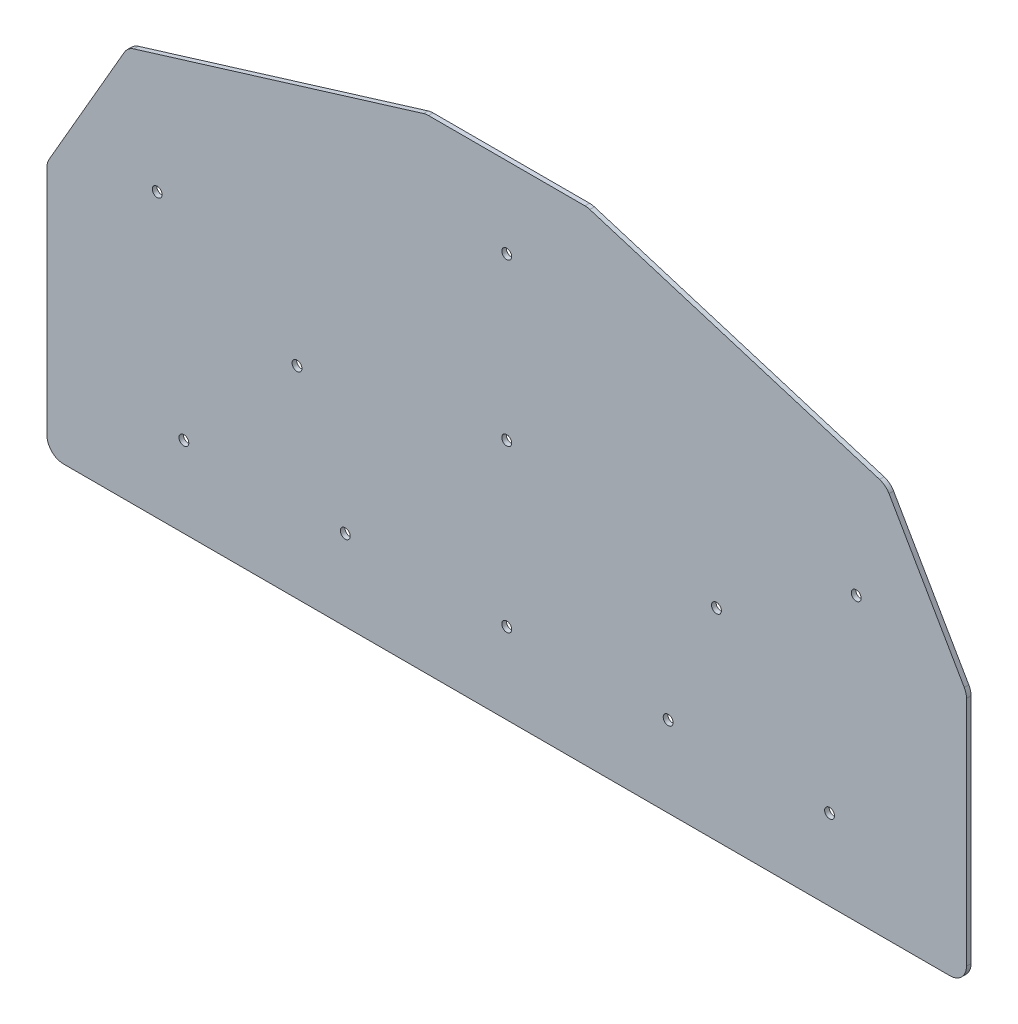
ISO-10303-21;
HEADER;
FILE_DESCRIPTION(('STEP AP214'),'2;1');
FILE_NAME('part.step','',(''),(''),'','','');
FILE_SCHEMA(('AUTOMOTIVE_DESIGN { 1 0 10303 214 1 1 1 1 }'));
ENDSEC;
DATA;
#1=APPLICATION_CONTEXT('core data for automotive mechanical design processes');
#2=APPLICATION_PROTOCOL_DEFINITION('international standard','automotive_design',2000,#1);
#3=PRODUCT_CONTEXT('',#1,'mechanical');
#4=PRODUCT('Part','Part','',(#3));
#5=PRODUCT_RELATED_PRODUCT_CATEGORY('part','',(#4));
#6=PRODUCT_DEFINITION_FORMATION('','',#4);
#7=PRODUCT_DEFINITION_CONTEXT('part definition',#1,'design');
#8=PRODUCT_DEFINITION('design','',#6,#7);
#9=PRODUCT_DEFINITION_SHAPE('','',#8);
#10=(LENGTH_UNIT() NAMED_UNIT(*) SI_UNIT(.MILLI.,.METRE.));
#11=(NAMED_UNIT(*) PLANE_ANGLE_UNIT() SI_UNIT($,.RADIAN.));
#12=(NAMED_UNIT(*) SI_UNIT($,.STERADIAN.) SOLID_ANGLE_UNIT());
#13=UNCERTAINTY_MEASURE_WITH_UNIT(LENGTH_MEASURE(1.E-05),#10,'distance_accuracy_value','');
#14=(GEOMETRIC_REPRESENTATION_CONTEXT(3) GLOBAL_UNCERTAINTY_ASSIGNED_CONTEXT((#13)) GLOBAL_UNIT_ASSIGNED_CONTEXT((#10,
#11,#12)) REPRESENTATION_CONTEXT('',''));
#15=CARTESIAN_POINT('',(0.,0.,0.));
#16=DIRECTION('',(0.,0.,1.));
#17=DIRECTION('',(1.,0.,0.));
#18=AXIS2_PLACEMENT_3D('',#15,#16,#17);
#19=CARTESIAN_POINT('',(153.7249135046,5.55625,1.524));
#20=DIRECTION('',(1.,0.,0.));
#21=DIRECTION('',(0.,0.,-1.));
#22=AXIS2_PLACEMENT_3D('',#19,#20,#21);
#23=PLANE('',#22);
#24=DIRECTION('',(0.,1.,0.));
#25=VECTOR('',#24,1.);
#26=CARTESIAN_POINT('',(153.7249135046,80.9625,1.524));
#27=LINE('',#26,#25);
#28=CARTESIAN_POINT('',(153.7249135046,5.5562499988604,1.524));
#29=VERTEX_POINT('',#28);
#30=CARTESIAN_POINT('',(153.7249135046,83.0893467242,1.524));
#31=VERTEX_POINT('',#30);
#32=EDGE_CURVE('E253',#29,#31,#27,.T.);
#33=ORIENTED_EDGE('',*,*,#32,.F.);
#34=DIRECTION('',(0.,0.,1.));
#35=VECTOR('',#34,1.);
#36=CARTESIAN_POINT('',(153.7249135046,5.55624999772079,0.762));
#37=LINE('',#36,#35);
#38=CARTESIAN_POINT('',(153.7249135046,5.5562499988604,0.));
#39=VERTEX_POINT('',#38);
#40=EDGE_CURVE('E152',#29,#39,#37,.F.);
#41=ORIENTED_EDGE('',*,*,#40,.T.);
#42=DIRECTION('',(0.,1.,0.));
#43=VECTOR('',#42,1.);
#44=CARTESIAN_POINT('',(153.7249135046,80.9625,0.));
#45=LINE('',#44,#43);
#46=CARTESIAN_POINT('',(153.7249135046,83.0893467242,0.));
#47=VERTEX_POINT('',#46);
#48=EDGE_CURVE('E289',#39,#47,#45,.T.);
#49=ORIENTED_EDGE('',*,*,#48,.T.);
#50=DIRECTION('',(0.,0.,-1.));
#51=VECTOR('',#50,1.);
#52=CARTESIAN_POINT('',(153.7249135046,83.0893467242,0.762));
#53=LINE('',#52,#51);
#54=EDGE_CURVE('E193',#47,#31,#53,.F.);
#55=ORIENTED_EDGE('',*,*,#54,.T.);
#56=EDGE_LOOP('',(#33,#41,#49,#55));
#57=FACE_BOUND('',#56,.T.);
#58=ADVANCED_FACE('F15',(#57),#23,.T.);
#59=CARTESIAN_POINT('',(148.1686635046,83.0893467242,0.));
#60=DIRECTION('',(0.,0.,1.));
#61=DIRECTION('',(1.,0.,0.));
#62=AXIS2_PLACEMENT_3D('',#59,#60,#61);
#63=CYLINDRICAL_SURFACE('',#62,5.55624999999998);
#64=ORIENTED_EDGE('',*,*,#54,.F.);
#65=CARTESIAN_POINT('',(148.1686635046,83.0893467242,0.));
#66=DIRECTION('',(0.,0.,1.));
#67=DIRECTION('',(1.,0.,0.));
#68=AXIS2_PLACEMENT_3D('',#65,#66,#67);
#69=CIRCLE('',#68,5.55624999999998);
#70=CARTESIAN_POINT('',(152.980517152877,85.8674717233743,0.));
#71=VERTEX_POINT('',#70);
#72=EDGE_CURVE('E286',#47,#71,#69,.T.);
#73=ORIENTED_EDGE('',*,*,#72,.T.);
#74=DIRECTION('',(0.,0.,1.));
#75=VECTOR('',#74,1.);
#76=CARTESIAN_POINT('',(152.9805171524,85.8674717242,0.762));
#77=LINE('',#76,#75);
#78=CARTESIAN_POINT('',(152.980517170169,85.8674717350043,1.524));
#79=VERTEX_POINT('',#78);
#80=EDGE_CURVE('E190',#71,#79,#77,.T.);
#81=ORIENTED_EDGE('',*,*,#80,.T.);
#82=CARTESIAN_POINT('',(148.1686635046,83.0893467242,1.524));
#83=DIRECTION('',(0.,0.,1.));
#84=DIRECTION('',(1.,0.,0.));
#85=AXIS2_PLACEMENT_3D('',#82,#83,#84);
#86=CIRCLE('',#85,5.55624999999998);
#87=EDGE_CURVE('E251',#31,#79,#86,.T.);
#88=ORIENTED_EDGE('',*,*,#87,.F.);
#89=EDGE_LOOP('',(#64,#73,#81,#88));
#90=FACE_BOUND('',#89,.T.);
#91=ADVANCED_FACE('F345',(#90),#63,.T.);
#92=CARTESIAN_POINT('',(127.8301796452,129.4291341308,0.));
#93=DIRECTION('',(-0.866025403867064,-0.499999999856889,0.));
#94=DIRECTION('',(0.499999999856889,-0.866025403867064,0.));
#95=AXIS2_PLACEMENT_3D('',#92,#93,#94);
#96=PLANE('',#95);
#97=ORIENTED_EDGE('',*,*,#80,.F.);
#98=DIRECTION('',(0.499999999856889,-0.866025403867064,0.));
#99=VECTOR('',#98,1.);
#100=CARTESIAN_POINT('',(127.8301796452,129.4291341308,0.));
#101=LINE('',#100,#99);
#102=CARTESIAN_POINT('',(127.830179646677,129.429134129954,0.));
#103=VERTEX_POINT('',#102);
#104=EDGE_CURVE('E284',#71,#103,#101,.F.);
#105=ORIENTED_EDGE('',*,*,#104,.T.);
#106=DIRECTION('',(0.,0.,-1.));
#107=VECTOR('',#106,1.);
#108=CARTESIAN_POINT('',(127.830179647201,129.429134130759,0.762));
#109=LINE('',#108,#107);
#110=CARTESIAN_POINT('',(127.83017965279,129.42913413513,1.524));
#111=VERTEX_POINT('',#110);
#112=EDGE_CURVE('E127',#103,#111,#109,.F.);
#113=ORIENTED_EDGE('',*,*,#112,.T.);
#114=DIRECTION('',(-0.500000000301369,0.866025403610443,0.));
#115=VECTOR('',#114,1.);
#116=CARTESIAN_POINT('',(152.980517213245,85.867471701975,1.524));
#117=LINE('',#116,#115);
#118=EDGE_CURVE('E249',#79,#111,#117,.T.);
#119=ORIENTED_EDGE('',*,*,#118,.F.);
#120=EDGE_LOOP('',(#97,#105,#113,#119));
#121=FACE_BOUND('',#120,.T.);
#122=ADVANCED_FACE('F348',(#121),#96,.F.);
#123=CARTESIAN_POINT('',(123.0183259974,126.6510091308,1.524));
#124=DIRECTION('',(0.,0.,-1.));
#125=DIRECTION('',(0.,1.,0.));
#126=AXIS2_PLACEMENT_3D('',#123,#124,#125);
#127=CYLINDRICAL_SURFACE('',#126,5.55625000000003);
#128=ORIENTED_EDGE('',*,*,#112,.F.);
#129=CARTESIAN_POINT('',(123.0183259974,126.6510091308,0.));
#130=DIRECTION('',(0.,0.,-1.));
#131=DIRECTION('',(0.,1.,0.));
#132=AXIS2_PLACEMENT_3D('',#129,#130,#131);
#133=CIRCLE('',#132,5.55625000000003);
#134=CARTESIAN_POINT('',(124.648003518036,131.962888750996,0.));
#135=VERTEX_POINT('',#134);
#136=EDGE_CURVE('E19',#103,#135,#133,.F.);
#137=ORIENTED_EDGE('',*,*,#136,.T.);
#138=DIRECTION('',(0.,0.,1.));
#139=VECTOR('',#138,1.);
#140=CARTESIAN_POINT('',(124.6480035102,131.9628887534,0.762));
#141=LINE('',#140,#139);
#142=CARTESIAN_POINT('',(124.648003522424,131.96288877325,1.524));
#143=VERTEX_POINT('',#142);
#144=EDGE_CURVE('E134',#135,#143,#141,.T.);
#145=ORIENTED_EDGE('',*,*,#144,.T.);
#146=CARTESIAN_POINT('',(123.0183259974,126.6510091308,1.524));
#147=DIRECTION('',(0.,0.,-1.));
#148=DIRECTION('',(0.,1.,0.));
#149=AXIS2_PLACEMENT_3D('',#146,#147,#148);
#150=CIRCLE('',#149,5.55625000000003);
#151=EDGE_CURVE('E247',#111,#143,#150,.F.);
#152=ORIENTED_EDGE('',*,*,#151,.F.);
#153=EDGE_LOOP('',(#128,#137,#145,#152));
#154=FACE_BOUND('',#153,.T.);
#155=ADVANCED_FACE('F151',(#154),#127,.T.);
#156=CARTESIAN_POINT('',(27.784017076,161.6806296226,0.));
#157=DIRECTION('',(-0.29330529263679,-0.956018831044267,0.));
#158=DIRECTION('',(0.956018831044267,-0.29330529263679,0.));
#159=AXIS2_PLACEMENT_3D('',#156,#157,#158);
#160=PLANE('',#159);
#161=ORIENTED_EDGE('',*,*,#144,.F.);
#162=DIRECTION('',(0.956018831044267,-0.29330529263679,0.));
#163=VECTOR('',#162,1.);
#164=CARTESIAN_POINT('',(27.784017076,161.6806296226,0.));
#165=LINE('',#164,#163);
#166=CARTESIAN_POINT('',(27.784017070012,161.680629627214,0.));
#167=VERTEX_POINT('',#166);
#168=EDGE_CURVE('E138',#135,#167,#165,.F.);
#169=ORIENTED_EDGE('',*,*,#168,.T.);
#170=DIRECTION('',(0.,0.,-1.));
#171=VECTOR('',#170,1.);
#172=CARTESIAN_POINT('',(27.7840170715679,161.680629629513,0.762));
#173=LINE('',#172,#171);
#174=CARTESIAN_POINT('',(27.7840170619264,161.68062960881,1.524));
#175=VERTEX_POINT('',#174);
#176=EDGE_CURVE('E140',#167,#175,#173,.F.);
#177=ORIENTED_EDGE('',*,*,#176,.T.);
#178=DIRECTION('',(-0.956018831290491,0.293305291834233,0.));
#179=VECTOR('',#178,1.);
#180=CARTESIAN_POINT('',(124.648003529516,131.962888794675,1.524));
#181=LINE('',#180,#179);
#182=EDGE_CURVE('E139',#143,#175,#181,.T.);
#183=ORIENTED_EDGE('',*,*,#182,.F.);
#184=EDGE_LOOP('',(#161,#169,#177,#183));
#185=FACE_BOUND('',#184,.T.);
#186=ADVANCED_FACE('F136',(#185),#160,.F.);
#187=CARTESIAN_POINT('',(26.1543395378,156.36875,1.524));
#188=DIRECTION('',(0.,0.,-1.));
#189=DIRECTION('',(0.,1.,0.));
#190=AXIS2_PLACEMENT_3D('',#187,#188,#189);
#191=CYLINDRICAL_SURFACE('',#190,5.55624999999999);
#192=ORIENTED_EDGE('',*,*,#176,.F.);
#193=CARTESIAN_POINT('',(26.1543395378,156.36875,0.));
#194=DIRECTION('',(0.,0.,-1.));
#195=DIRECTION('',(0.,1.,0.));
#196=AXIS2_PLACEMENT_3D('',#193,#194,#195);
#197=CIRCLE('',#196,5.55624999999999);
#198=CARTESIAN_POINT('',(26.1543395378,161.925,0.));
#199=VERTEX_POINT('',#198);
#200=EDGE_CURVE('E150',#167,#199,#197,.F.);
#201=ORIENTED_EDGE('',*,*,#200,.T.);
#202=DIRECTION('',(0.,0.,1.));
#203=VECTOR('',#202,1.);
#204=CARTESIAN_POINT('',(26.1543395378,161.925,0.762));
#205=LINE('',#204,#203);
#206=CARTESIAN_POINT('',(26.1543395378,161.925,1.524));
#207=VERTEX_POINT('',#206);
#208=EDGE_CURVE('E185',#199,#207,#205,.T.);
#209=ORIENTED_EDGE('',*,*,#208,.T.);
#210=CARTESIAN_POINT('',(26.1543395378,156.36875,1.524));
#211=DIRECTION('',(0.,0.,-1.));
#212=DIRECTION('',(0.,1.,0.));
#213=AXIS2_PLACEMENT_3D('',#210,#211,#212);
#214=CIRCLE('',#213,5.55624999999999);
#215=EDGE_CURVE('E244',#175,#207,#214,.F.);
#216=ORIENTED_EDGE('',*,*,#215,.F.);
#217=EDGE_LOOP('',(#192,#201,#209,#216));
#218=FACE_BOUND('',#217,.T.);
#219=ADVANCED_FACE('F371',(#218),#191,.T.);
#220=CARTESIAN_POINT('',(-26.1543395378,161.925,1.524));
#221=DIRECTION('',(0.,-1.,0.));
#222=DIRECTION('',(0.,0.,-1.));
#223=AXIS2_PLACEMENT_3D('',#220,#221,#222);
#224=PLANE('',#223);
#225=ORIENTED_EDGE('',*,*,#208,.F.);
#226=DIRECTION('',(-1.,0.,0.));
#227=VECTOR('',#226,1.);
#228=CARTESIAN_POINT('',(0.,161.925,0.));
#229=LINE('',#228,#227);
#230=CARTESIAN_POINT('',(-26.1543395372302,161.925,0.));
#231=VERTEX_POINT('',#230);
#232=EDGE_CURVE('E313',#199,#231,#229,.T.);
#233=ORIENTED_EDGE('',*,*,#232,.T.);
#234=DIRECTION('',(0.,0.,-1.));
#235=VECTOR('',#234,1.);
#236=CARTESIAN_POINT('',(-26.1543395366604,161.925,0.762));
#237=LINE('',#236,#235);
#238=CARTESIAN_POINT('',(-26.1543395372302,161.925,1.524));
#239=VERTEX_POINT('',#238);
#240=EDGE_CURVE('E182',#231,#239,#237,.F.);
#241=ORIENTED_EDGE('',*,*,#240,.T.);
#242=DIRECTION('',(-1.,0.,0.));
#243=VECTOR('',#242,1.);
#244=CARTESIAN_POINT('',(0.,161.925,1.524));
#245=LINE('',#244,#243);
#246=EDGE_CURVE('E243',#207,#239,#245,.T.);
#247=ORIENTED_EDGE('',*,*,#246,.F.);
#248=EDGE_LOOP('',(#225,#233,#241,#247));
#249=FACE_BOUND('',#248,.T.);
#250=ADVANCED_FACE('F369',(#249),#224,.F.);
#251=CARTESIAN_POINT('',(-26.1543395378,156.36875,1.524));
#252=DIRECTION('',(0.,0.,-1.));
#253=DIRECTION('',(0.,1.,0.));
#254=AXIS2_PLACEMENT_3D('',#251,#252,#253);
#255=CYLINDRICAL_SURFACE('',#254,5.55625000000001);
#256=ORIENTED_EDGE('',*,*,#240,.F.);
#257=CARTESIAN_POINT('',(-26.1543395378,156.36875,0.));
#258=DIRECTION('',(0.,0.,-1.));
#259=DIRECTION('',(0.,1.,0.));
#260=AXIS2_PLACEMENT_3D('',#257,#258,#259);
#261=CIRCLE('',#260,5.55625000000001);
#262=CARTESIAN_POINT('',(-27.784017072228,161.680629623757,0.));
#263=VERTEX_POINT('',#262);
#264=EDGE_CURVE('E310',#231,#263,#261,.F.);
#265=ORIENTED_EDGE('',*,*,#264,.T.);
#266=DIRECTION('',(0.,0.,1.));
#267=VECTOR('',#266,1.);
#268=CARTESIAN_POINT('',(-27.784017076,161.6806296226,0.762));
#269=LINE('',#268,#267);
#270=CARTESIAN_POINT('',(-27.7840170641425,161.680629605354,1.524));
#271=VERTEX_POINT('',#270);
#272=EDGE_CURVE('E179',#263,#271,#269,.T.);
#273=ORIENTED_EDGE('',*,*,#272,.T.);
#274=CARTESIAN_POINT('',(-26.1543395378,156.36875,1.524));
#275=DIRECTION('',(0.,0.,-1.));
#276=DIRECTION('',(0.,1.,0.));
#277=AXIS2_PLACEMENT_3D('',#274,#275,#276);
#278=CIRCLE('',#277,5.55625000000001);
#279=EDGE_CURVE('E241',#239,#271,#278,.F.);
#280=ORIENTED_EDGE('',*,*,#279,.F.);
#281=EDGE_LOOP('',(#256,#265,#273,#280));
#282=FACE_BOUND('',#281,.T.);
#283=ADVANCED_FACE('F366',(#282),#255,.T.);
#284=CARTESIAN_POINT('',(-124.6480035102,131.9628887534,0.));
#285=DIRECTION('',(0.29330529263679,-0.956018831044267,0.));
#286=DIRECTION('',(0.956018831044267,0.29330529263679,0.));
#287=AXIS2_PLACEMENT_3D('',#284,#285,#286);
#288=PLANE('',#287);
#289=ORIENTED_EDGE('',*,*,#272,.F.);
#290=DIRECTION('',(0.956018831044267,0.29330529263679,0.));
#291=VECTOR('',#290,1.);
#292=CARTESIAN_POINT('',(-124.6480035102,131.9628887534,0.));
#293=LINE('',#292,#291);
#294=CARTESIAN_POINT('',(-124.64800352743,131.962888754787,0.));
#295=VERTEX_POINT('',#294);
#296=EDGE_CURVE('E307',#263,#295,#293,.F.);
#297=ORIENTED_EDGE('',*,*,#296,.T.);
#298=DIRECTION('',(0.,0.,-1.));
#299=VECTOR('',#298,1.);
#300=CARTESIAN_POINT('',(-124.648003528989,131.962888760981,0.762));
#301=LINE('',#300,#299);
#302=CARTESIAN_POINT('',(-124.648003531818,131.962888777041,1.524));
#303=VERTEX_POINT('',#302);
#304=EDGE_CURVE('E176',#295,#303,#301,.F.);
#305=ORIENTED_EDGE('',*,*,#304,.T.);
#306=DIRECTION('',(-0.956018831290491,-0.293305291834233,0.));
#307=VECTOR('',#306,1.);
#308=CARTESIAN_POINT('',(-27.7840170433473,161.68062959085,1.524));
#309=LINE('',#308,#307);
#310=EDGE_CURVE('E239',#271,#303,#309,.T.);
#311=ORIENTED_EDGE('',*,*,#310,.F.);
#312=EDGE_LOOP('',(#289,#297,#305,#311));
#313=FACE_BOUND('',#312,.T.);
#314=ADVANCED_FACE('F363',(#313),#288,.F.);
#315=CARTESIAN_POINT('',(-123.0183259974,126.6510091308,1.524));
#316=DIRECTION('',(0.,0.,-1.));
#317=DIRECTION('',(0.,1.,0.));
#318=AXIS2_PLACEMENT_3D('',#315,#316,#317);
#319=CYLINDRICAL_SURFACE('',#318,5.55624999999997);
#320=ORIENTED_EDGE('',*,*,#304,.F.);
#321=CARTESIAN_POINT('',(-123.0183259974,126.6510091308,0.));
#322=DIRECTION('',(0.,0.,-1.));
#323=DIRECTION('',(0.,1.,0.));
#324=AXIS2_PLACEMENT_3D('',#321,#322,#323);
#325=CIRCLE('',#324,5.55624999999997);
#326=CARTESIAN_POINT('',(-127.830179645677,129.429134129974,0.));
#327=VERTEX_POINT('',#326);
#328=EDGE_CURVE('E304',#295,#327,#325,.F.);
#329=ORIENTED_EDGE('',*,*,#328,.T.);
#330=DIRECTION('',(0.,0.,1.));
#331=VECTOR('',#330,1.);
#332=CARTESIAN_POINT('',(-127.8301796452,129.4291341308,0.762));
#333=LINE('',#332,#331);
#334=CARTESIAN_POINT('',(-127.83017965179,129.42913413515,1.524));
#335=VERTEX_POINT('',#334);
#336=EDGE_CURVE('E173',#327,#335,#333,.T.);
#337=ORIENTED_EDGE('',*,*,#336,.T.);
#338=CARTESIAN_POINT('',(-123.0183259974,126.6510091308,1.524));
#339=DIRECTION('',(0.,0.,-1.));
#340=DIRECTION('',(0.,1.,0.));
#341=AXIS2_PLACEMENT_3D('',#338,#339,#340);
#342=CIRCLE('',#341,5.55624999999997);
#343=EDGE_CURVE('E237',#303,#335,#342,.F.);
#344=ORIENTED_EDGE('',*,*,#343,.F.);
#345=EDGE_LOOP('',(#320,#329,#337,#344));
#346=FACE_BOUND('',#345,.T.);
#347=ADVANCED_FACE('F359',(#346),#319,.T.);
#348=CARTESIAN_POINT('',(-152.9805171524,85.8674717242,0.));
#349=DIRECTION('',(0.866025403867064,-0.499999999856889,0.));
#350=DIRECTION('',(0.499999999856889,0.866025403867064,0.));
#351=AXIS2_PLACEMENT_3D('',#348,#349,#350);
#352=PLANE('',#351);
#353=DIRECTION('',(0.,0.,-1.));
#354=VECTOR('',#353,1.);
#355=CARTESIAN_POINT('',(-152.980517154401,85.8674717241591,0.762));
#356=LINE('',#355,#354);
#357=CARTESIAN_POINT('',(-152.980517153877,85.8674717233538,0.));
#358=VERTEX_POINT('',#357);
#359=CARTESIAN_POINT('',(-152.980517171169,85.8674717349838,1.524));
#360=VERTEX_POINT('',#359);
#361=EDGE_CURVE('E170',#358,#360,#356,.F.);
#362=ORIENTED_EDGE('',*,*,#361,.T.);
#363=DIRECTION('',(-0.500000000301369,-0.866025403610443,0.));
#364=VECTOR('',#363,1.);
#365=CARTESIAN_POINT('',(-127.830179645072,129.42913416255,1.524));
#366=LINE('',#365,#364);
#367=EDGE_CURVE('E235',#335,#360,#366,.T.);
#368=ORIENTED_EDGE('',*,*,#367,.F.);
#369=ORIENTED_EDGE('',*,*,#336,.F.);
#370=DIRECTION('',(0.499999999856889,0.866025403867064,0.));
#371=VECTOR('',#370,1.);
#372=CARTESIAN_POINT('',(-152.9805171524,85.8674717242,0.));
#373=LINE('',#372,#371);
#374=EDGE_CURVE('E301',#327,#358,#373,.F.);
#375=ORIENTED_EDGE('',*,*,#374,.T.);
#376=EDGE_LOOP('',(#362,#368,#369,#375));
#377=FACE_BOUND('',#376,.T.);
#378=ADVANCED_FACE('F355',(#377),#352,.F.);
#379=CARTESIAN_POINT('',(-148.1686635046,83.0893467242,0.));
#380=DIRECTION('',(0.,0.,1.));
#381=DIRECTION('',(1.,0.,0.));
#382=AXIS2_PLACEMENT_3D('',#379,#380,#381);
#383=CYLINDRICAL_SURFACE('',#382,5.55625000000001);
#384=ORIENTED_EDGE('',*,*,#361,.F.);
#385=CARTESIAN_POINT('',(-148.1686635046,83.0893467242,0.));
#386=DIRECTION('',(0.,0.,1.));
#387=DIRECTION('',(1.,0.,0.));
#388=AXIS2_PLACEMENT_3D('',#385,#386,#387);
#389=CIRCLE('',#388,5.55625000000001);
#390=CARTESIAN_POINT('',(-153.7249135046,83.0893467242,0.));
#391=VERTEX_POINT('',#390);
#392=EDGE_CURVE('E298',#358,#391,#389,.T.);
#393=ORIENTED_EDGE('',*,*,#392,.T.);
#394=DIRECTION('',(0.,0.,-1.));
#395=VECTOR('',#394,1.);
#396=CARTESIAN_POINT('',(-153.7249135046,83.0893467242,0.762));
#397=LINE('',#396,#395);
#398=CARTESIAN_POINT('',(-153.7249135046,83.0893467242,1.524));
#399=VERTEX_POINT('',#398);
#400=EDGE_CURVE('E168',#399,#391,#397,.T.);
#401=ORIENTED_EDGE('',*,*,#400,.F.);
#402=CARTESIAN_POINT('',(-148.1686635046,83.0893467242,1.524));
#403=DIRECTION('',(0.,0.,1.));
#404=DIRECTION('',(1.,0.,0.));
#405=AXIS2_PLACEMENT_3D('',#402,#403,#404);
#406=CIRCLE('',#405,5.55625000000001);
#407=EDGE_CURVE('E233',#360,#399,#406,.T.);
#408=ORIENTED_EDGE('',*,*,#407,.F.);
#409=EDGE_LOOP('',(#384,#393,#401,#408));
#410=FACE_BOUND('',#409,.T.);
#411=ADVANCED_FACE('F352',(#410),#383,.T.);
#412=CARTESIAN_POINT('',(-153.7249135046,5.55625,0.));
#413=DIRECTION('',(-1.,0.,0.));
#414=DIRECTION('',(0.,0.,1.));
#415=AXIS2_PLACEMENT_3D('',#412,#413,#414);
#416=PLANE('',#415);
#417=DIRECTION('',(0.,-1.,0.));
#418=VECTOR('',#417,1.);
#419=CARTESIAN_POINT('',(-153.7249135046,80.9625,0.));
#420=LINE('',#419,#418);
#421=CARTESIAN_POINT('',(-153.7249135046,5.55624999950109,0.));
#422=VERTEX_POINT('',#421);
#423=EDGE_CURVE('E297',#391,#422,#420,.T.);
#424=ORIENTED_EDGE('',*,*,#423,.T.);
#425=DIRECTION('',(0.,0.,-1.));
#426=VECTOR('',#425,1.);
#427=CARTESIAN_POINT('',(-153.7249135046,5.55624999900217,0.762));
#428=LINE('',#427,#426);
#429=CARTESIAN_POINT('',(-153.7249135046,5.55624999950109,1.524));
#430=VERTEX_POINT('',#429);
#431=EDGE_CURVE('E165',#422,#430,#428,.F.);
#432=ORIENTED_EDGE('',*,*,#431,.T.);
#433=DIRECTION('',(0.,-1.,0.));
#434=VECTOR('',#433,1.);
#435=CARTESIAN_POINT('',(-153.7249135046,80.9625,1.524));
#436=LINE('',#435,#434);
#437=EDGE_CURVE('E232',#399,#430,#436,.T.);
#438=ORIENTED_EDGE('',*,*,#437,.F.);
#439=ORIENTED_EDGE('',*,*,#400,.T.);
#440=EDGE_LOOP('',(#424,#432,#438,#439));
#441=FACE_BOUND('',#440,.T.);
#442=ADVANCED_FACE('F331',(#441),#416,.T.);
#443=CARTESIAN_POINT('',(-148.1686635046,5.55625,1.524));
#444=DIRECTION('',(0.,0.,-1.));
#445=DIRECTION('',(0.,1.,0.));
#446=AXIS2_PLACEMENT_3D('',#443,#444,#445);
#447=CYLINDRICAL_SURFACE('',#446,5.55624999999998);
#448=DIRECTION('',(0.,0.,1.));
#449=VECTOR('',#448,1.);
#450=CARTESIAN_POINT('',(-148.1686635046,0.,0.762));
#451=LINE('',#450,#449);
#452=CARTESIAN_POINT('',(-148.1686635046,0.,0.));
#453=VERTEX_POINT('',#452);
#454=CARTESIAN_POINT('',(-148.1686635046,0.,1.524));
#455=VERTEX_POINT('',#454);
#456=EDGE_CURVE('E159',#453,#455,#451,.T.);
#457=ORIENTED_EDGE('',*,*,#456,.T.);
#458=CARTESIAN_POINT('',(-148.1686635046,5.55625,1.524));
#459=DIRECTION('',(0.,0.,-1.));
#460=DIRECTION('',(0.,1.,0.));
#461=AXIS2_PLACEMENT_3D('',#458,#459,#460);
#462=CIRCLE('',#461,5.55624999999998);
#463=EDGE_CURVE('E230',#430,#455,#462,.F.);
#464=ORIENTED_EDGE('',*,*,#463,.F.);
#465=ORIENTED_EDGE('',*,*,#431,.F.);
#466=CARTESIAN_POINT('',(-148.1686635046,5.55625,0.));
#467=DIRECTION('',(0.,0.,-1.));
#468=DIRECTION('',(0.,1.,0.));
#469=AXIS2_PLACEMENT_3D('',#466,#467,#468);
#470=CIRCLE('',#469,5.55624999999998);
#471=EDGE_CURVE('E294',#422,#453,#470,.F.);
#472=ORIENTED_EDGE('',*,*,#471,.T.);
#473=EDGE_LOOP('',(#457,#464,#465,#472));
#474=FACE_BOUND('',#473,.T.);
#475=ADVANCED_FACE('F335',(#474),#447,.T.);
#476=CARTESIAN_POINT('',(148.1686635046,0.,0.));
#477=DIRECTION('',(0.,1.,0.));
#478=DIRECTION('',(-1.,0.,0.));
#479=AXIS2_PLACEMENT_3D('',#476,#477,#478);
#480=PLANE('',#479);
#481=DIRECTION('',(0.,0.,-1.));
#482=VECTOR('',#481,1.);
#483=CARTESIAN_POINT('',(148.168663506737,0.,0.762));
#484=LINE('',#483,#482);
#485=CARTESIAN_POINT('',(148.168663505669,0.,0.));
#486=VERTEX_POINT('',#485);
#487=CARTESIAN_POINT('',(148.168663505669,0.,1.524));
#488=VERTEX_POINT('',#487);
#489=EDGE_CURVE('E153',#486,#488,#484,.F.);
#490=ORIENTED_EDGE('',*,*,#489,.T.);
#491=DIRECTION('',(1.,0.,0.));
#492=VECTOR('',#491,1.);
#493=CARTESIAN_POINT('',(0.,0.,1.524));
#494=LINE('',#493,#492);
#495=EDGE_CURVE('E34',#455,#488,#494,.T.);
#496=ORIENTED_EDGE('',*,*,#495,.F.);
#497=ORIENTED_EDGE('',*,*,#456,.F.);
#498=DIRECTION('',(1.,0.,0.));
#499=VECTOR('',#498,1.);
#500=CARTESIAN_POINT('',(0.,0.,0.));
#501=LINE('',#500,#499);
#502=EDGE_CURVE('E293',#453,#486,#501,.T.);
#503=ORIENTED_EDGE('',*,*,#502,.T.);
#504=EDGE_LOOP('',(#490,#496,#497,#503));
#505=FACE_BOUND('',#504,.T.);
#506=ADVANCED_FACE('F338',(#505),#480,.F.);
#507=CARTESIAN_POINT('',(148.1686635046,5.55625,1.524));
#508=DIRECTION('',(0.,0.,-1.));
#509=DIRECTION('',(0.,1.,0.));
#510=AXIS2_PLACEMENT_3D('',#507,#508,#509);
#511=CYLINDRICAL_SURFACE('',#510,5.55625000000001);
#512=ORIENTED_EDGE('',*,*,#40,.F.);
#513=CARTESIAN_POINT('',(148.1686635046,5.55625,1.524));
#514=DIRECTION('',(0.,0.,-1.));
#515=DIRECTION('',(0.,1.,0.));
#516=AXIS2_PLACEMENT_3D('',#513,#514,#515);
#517=CIRCLE('',#516,5.55625000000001);
#518=EDGE_CURVE('E228',#488,#29,#517,.F.);
#519=ORIENTED_EDGE('',*,*,#518,.F.);
#520=ORIENTED_EDGE('',*,*,#489,.F.);
#521=CARTESIAN_POINT('',(148.1686635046,5.55625,0.));
#522=DIRECTION('',(0.,0.,-1.));
#523=DIRECTION('',(0.,1.,0.));
#524=AXIS2_PLACEMENT_3D('',#521,#522,#523);
#525=CIRCLE('',#524,5.55625000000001);
#526=EDGE_CURVE('E290',#486,#39,#525,.F.);
#527=ORIENTED_EDGE('',*,*,#526,.T.);
#528=EDGE_LOOP('',(#512,#519,#520,#527));
#529=FACE_BOUND('',#528,.T.);
#530=ADVANCED_FACE('F342',(#529),#511,.T.);
#531=CARTESIAN_POINT('',(0.,134.9375,0.));
#532=DIRECTION('',(0.,0.,1.));
#533=DIRECTION('',(1.,0.,0.));
#534=AXIS2_PLACEMENT_3D('',#531,#532,#533);
#535=CYLINDRICAL_SURFACE('',#534,1.651);
#536=CARTESIAN_POINT('',(0.,134.9375,1.524));
#537=DIRECTION('',(0.,0.,1.));
#538=DIRECTION('',(1.,0.,0.));
#539=AXIS2_PLACEMENT_3D('',#536,#537,#538);
#540=CIRCLE('',#539,1.651);
#541=CARTESIAN_POINT('',(1.651,134.9375,1.524));
#542=VERTEX_POINT('',#541);
#543=EDGE_CURVE('E225',#542,#542,#540,.F.);
#544=ORIENTED_EDGE('',*,*,#543,.F.);
#545=EDGE_LOOP('',(#544));
#546=FACE_BOUND('',#545,.T.);
#547=CARTESIAN_POINT('',(0.,134.9375,0.));
#548=DIRECTION('',(0.,0.,1.));
#549=DIRECTION('',(1.,0.,0.));
#550=AXIS2_PLACEMENT_3D('',#547,#548,#549);
#551=CIRCLE('',#550,1.651);
#552=CARTESIAN_POINT('',(1.651,134.9375,0.));
#553=VERTEX_POINT('',#552);
#554=EDGE_CURVE('E281',#553,#553,#551,.F.);
#555=ORIENTED_EDGE('',*,*,#554,.T.);
#556=EDGE_LOOP('',(#555));
#557=FACE_BOUND('',#556,.T.);
#558=ADVANCED_FACE('F428',(#546,#557),#535,.F.);
#559=CARTESIAN_POINT('',(0.,80.9625,0.));
#560=DIRECTION('',(0.,0.,1.));
#561=DIRECTION('',(1.,0.,0.));
#562=AXIS2_PLACEMENT_3D('',#559,#560,#561);
#563=CYLINDRICAL_SURFACE('',#562,1.651);
#564=CARTESIAN_POINT('',(0.,80.9625,1.524));
#565=DIRECTION('',(0.,0.,1.));
#566=DIRECTION('',(1.,0.,0.));
#567=AXIS2_PLACEMENT_3D('',#564,#565,#566);
#568=CIRCLE('',#567,1.651);
#569=CARTESIAN_POINT('',(1.651,80.9625,1.524));
#570=VERTEX_POINT('',#569);
#571=EDGE_CURVE('E222',#570,#570,#568,.F.);
#572=ORIENTED_EDGE('',*,*,#571,.F.);
#573=EDGE_LOOP('',(#572));
#574=FACE_BOUND('',#573,.T.);
#575=CARTESIAN_POINT('',(0.,80.9625,0.));
#576=DIRECTION('',(0.,0.,1.));
#577=DIRECTION('',(1.,0.,0.));
#578=AXIS2_PLACEMENT_3D('',#575,#576,#577);
#579=CIRCLE('',#578,1.651);
#580=CARTESIAN_POINT('',(1.651,80.9625,0.));
#581=VERTEX_POINT('',#580);
#582=EDGE_CURVE('E278',#581,#581,#579,.F.);
#583=ORIENTED_EDGE('',*,*,#582,.T.);
#584=EDGE_LOOP('',(#583));
#585=FACE_BOUND('',#584,.T.);
#586=ADVANCED_FACE('F424',(#574,#585),#563,.F.);
#587=CARTESIAN_POINT('',(-107.95,26.9875,0.));
#588=DIRECTION('',(0.,0.,1.));
#589=DIRECTION('',(1.,0.,0.));
#590=AXIS2_PLACEMENT_3D('',#587,#588,#589);
#591=CYLINDRICAL_SURFACE('',#590,1.651);
#592=CARTESIAN_POINT('',(-107.95,26.9875,1.524));
#593=DIRECTION('',(0.,0.,1.));
#594=DIRECTION('',(1.,0.,0.));
#595=AXIS2_PLACEMENT_3D('',#592,#593,#594);
#596=CIRCLE('',#595,1.651);
#597=CARTESIAN_POINT('',(-106.299,26.9875,1.524));
#598=VERTEX_POINT('',#597);
#599=EDGE_CURVE('E219',#598,#598,#596,.F.);
#600=ORIENTED_EDGE('',*,*,#599,.F.);
#601=EDGE_LOOP('',(#600));
#602=FACE_BOUND('',#601,.T.);
#603=CARTESIAN_POINT('',(-107.95,26.9875,0.));
#604=DIRECTION('',(0.,0.,1.));
#605=DIRECTION('',(1.,0.,0.));
#606=AXIS2_PLACEMENT_3D('',#603,#604,#605);
#607=CIRCLE('',#606,1.651);
#608=CARTESIAN_POINT('',(-106.299,26.9875,0.));
#609=VERTEX_POINT('',#608);
#610=EDGE_CURVE('E275',#609,#609,#607,.F.);
#611=ORIENTED_EDGE('',*,*,#610,.T.);
#612=EDGE_LOOP('',(#611));
#613=FACE_BOUND('',#612,.T.);
#614=ADVANCED_FACE('F420',(#602,#613),#591,.F.);
#615=CARTESIAN_POINT('',(107.95,26.9875,0.));
#616=DIRECTION('',(0.,0.,1.));
#617=DIRECTION('',(1.,0.,0.));
#618=AXIS2_PLACEMENT_3D('',#615,#616,#617);
#619=CYLINDRICAL_SURFACE('',#618,1.651);
#620=CARTESIAN_POINT('',(107.95,26.9875,1.524));
#621=DIRECTION('',(0.,0.,1.));
#622=DIRECTION('',(1.,0.,0.));
#623=AXIS2_PLACEMENT_3D('',#620,#621,#622);
#624=CIRCLE('',#623,1.651);
#625=CARTESIAN_POINT('',(109.601,26.9875,1.524));
#626=VERTEX_POINT('',#625);
#627=EDGE_CURVE('E216',#626,#626,#624,.F.);
#628=ORIENTED_EDGE('',*,*,#627,.F.);
#629=EDGE_LOOP('',(#628));
#630=FACE_BOUND('',#629,.T.);
#631=CARTESIAN_POINT('',(107.95,26.9875,0.));
#632=DIRECTION('',(0.,0.,1.));
#633=DIRECTION('',(1.,0.,0.));
#634=AXIS2_PLACEMENT_3D('',#631,#632,#633);
#635=CIRCLE('',#634,1.651);
#636=CARTESIAN_POINT('',(109.601,26.9875,0.));
#637=VERTEX_POINT('',#636);
#638=EDGE_CURVE('E272',#637,#637,#635,.F.);
#639=ORIENTED_EDGE('',*,*,#638,.T.);
#640=EDGE_LOOP('',(#639));
#641=FACE_BOUND('',#640,.T.);
#642=ADVANCED_FACE('F416',(#630,#641),#619,.F.);
#643=CARTESIAN_POINT('',(116.8593029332,94.45625,0.));
#644=DIRECTION('',(0.,0.,1.));
#645=DIRECTION('',(1.,0.,0.));
#646=AXIS2_PLACEMENT_3D('',#643,#644,#645);
#647=CYLINDRICAL_SURFACE('',#646,1.65099999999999);
#648=CARTESIAN_POINT('',(116.8593029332,94.45625,1.524));
#649=DIRECTION('',(0.,0.,1.));
#650=DIRECTION('',(1.,0.,0.));
#651=AXIS2_PLACEMENT_3D('',#648,#649,#650);
#652=CIRCLE('',#651,1.65099999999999);
#653=CARTESIAN_POINT('',(118.5103029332,94.45625,1.524));
#654=VERTEX_POINT('',#653);
#655=EDGE_CURVE('E213',#654,#654,#652,.F.);
#656=ORIENTED_EDGE('',*,*,#655,.F.);
#657=EDGE_LOOP('',(#656));
#658=FACE_BOUND('',#657,.T.);
#659=CARTESIAN_POINT('',(116.8593029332,94.45625,0.));
#660=DIRECTION('',(0.,0.,1.));
#661=DIRECTION('',(1.,0.,0.));
#662=AXIS2_PLACEMENT_3D('',#659,#660,#661);
#663=CIRCLE('',#662,1.65099999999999);
#664=CARTESIAN_POINT('',(118.5103029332,94.45625,0.));
#665=VERTEX_POINT('',#664);
#666=EDGE_CURVE('E269',#665,#665,#663,.F.);
#667=ORIENTED_EDGE('',*,*,#666,.T.);
#668=EDGE_LOOP('',(#667));
#669=FACE_BOUND('',#668,.T.);
#670=ADVANCED_FACE('F412',(#658,#669),#647,.F.);
#671=CARTESIAN_POINT('',(70.115581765,67.46875,0.));
#672=DIRECTION('',(0.,0.,1.));
#673=DIRECTION('',(1.,0.,0.));
#674=AXIS2_PLACEMENT_3D('',#671,#672,#673);
#675=CYLINDRICAL_SURFACE('',#674,1.65099999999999);
#676=CARTESIAN_POINT('',(70.115581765,67.46875,1.524));
#677=DIRECTION('',(0.,0.,1.));
#678=DIRECTION('',(1.,0.,0.));
#679=AXIS2_PLACEMENT_3D('',#676,#677,#678);
#680=CIRCLE('',#679,1.65099999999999);
#681=CARTESIAN_POINT('',(71.766581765,67.46875,1.524));
#682=VERTEX_POINT('',#681);
#683=EDGE_CURVE('E210',#682,#682,#680,.F.);
#684=ORIENTED_EDGE('',*,*,#683,.F.);
#685=EDGE_LOOP('',(#684));
#686=FACE_BOUND('',#685,.T.);
#687=CARTESIAN_POINT('',(70.115581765,67.46875,0.));
#688=DIRECTION('',(0.,0.,1.));
#689=DIRECTION('',(1.,0.,0.));
#690=AXIS2_PLACEMENT_3D('',#687,#688,#689);
#691=CIRCLE('',#690,1.65099999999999);
#692=CARTESIAN_POINT('',(71.766581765,67.46875,0.));
#693=VERTEX_POINT('',#692);
#694=EDGE_CURVE('E266',#693,#693,#691,.F.);
#695=ORIENTED_EDGE('',*,*,#694,.T.);
#696=EDGE_LOOP('',(#695));
#697=FACE_BOUND('',#696,.T.);
#698=ADVANCED_FACE('F408',(#686,#697),#675,.F.);
#699=CARTESIAN_POINT('',(-116.8593029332,94.45625,0.));
#700=DIRECTION('',(0.,0.,1.));
#701=DIRECTION('',(1.,0.,0.));
#702=AXIS2_PLACEMENT_3D('',#699,#700,#701);
#703=CYLINDRICAL_SURFACE('',#702,1.651);
#704=CARTESIAN_POINT('',(-116.8593029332,94.45625,1.524));
#705=DIRECTION('',(0.,0.,1.));
#706=DIRECTION('',(1.,0.,0.));
#707=AXIS2_PLACEMENT_3D('',#704,#705,#706);
#708=CIRCLE('',#707,1.651);
#709=CARTESIAN_POINT('',(-115.2083029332,94.45625,1.524));
#710=VERTEX_POINT('',#709);
#711=EDGE_CURVE('E207',#710,#710,#708,.F.);
#712=ORIENTED_EDGE('',*,*,#711,.F.);
#713=EDGE_LOOP('',(#712));
#714=FACE_BOUND('',#713,.T.);
#715=CARTESIAN_POINT('',(-116.8593029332,94.45625,0.));
#716=DIRECTION('',(0.,0.,1.));
#717=DIRECTION('',(1.,0.,0.));
#718=AXIS2_PLACEMENT_3D('',#715,#716,#717);
#719=CIRCLE('',#718,1.651);
#720=CARTESIAN_POINT('',(-115.2083029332,94.45625,0.));
#721=VERTEX_POINT('',#720);
#722=EDGE_CURVE('E263',#721,#721,#719,.F.);
#723=ORIENTED_EDGE('',*,*,#722,.T.);
#724=EDGE_LOOP('',(#723));
#725=FACE_BOUND('',#724,.T.);
#726=ADVANCED_FACE('F404',(#714,#725),#703,.F.);
#727=CARTESIAN_POINT('',(-70.115581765,67.46875,0.));
#728=DIRECTION('',(0.,0.,1.));
#729=DIRECTION('',(1.,0.,0.));
#730=AXIS2_PLACEMENT_3D('',#727,#728,#729);
#731=CYLINDRICAL_SURFACE('',#730,1.65100000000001);
#732=CARTESIAN_POINT('',(-70.115581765,67.46875,1.524));
#733=DIRECTION('',(0.,0.,1.));
#734=DIRECTION('',(1.,0.,0.));
#735=AXIS2_PLACEMENT_3D('',#732,#733,#734);
#736=CIRCLE('',#735,1.65100000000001);
#737=CARTESIAN_POINT('',(-68.464581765,67.46875,1.524));
#738=VERTEX_POINT('',#737);
#739=EDGE_CURVE('E204',#738,#738,#736,.F.);
#740=ORIENTED_EDGE('',*,*,#739,.F.);
#741=EDGE_LOOP('',(#740));
#742=FACE_BOUND('',#741,.T.);
#743=CARTESIAN_POINT('',(-70.115581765,67.46875,0.));
#744=DIRECTION('',(0.,0.,1.));
#745=DIRECTION('',(1.,0.,0.));
#746=AXIS2_PLACEMENT_3D('',#743,#744,#745);
#747=CIRCLE('',#746,1.65100000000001);
#748=CARTESIAN_POINT('',(-68.464581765,67.46875,0.));
#749=VERTEX_POINT('',#748);
#750=EDGE_CURVE('E260',#749,#749,#747,.F.);
#751=ORIENTED_EDGE('',*,*,#750,.T.);
#752=EDGE_LOOP('',(#751));
#753=FACE_BOUND('',#752,.T.);
#754=ADVANCED_FACE('F400',(#742,#753),#731,.F.);
#755=CARTESIAN_POINT('',(-53.975,26.9875,0.));
#756=DIRECTION('',(0.,0.,1.));
#757=DIRECTION('',(1.,0.,0.));
#758=AXIS2_PLACEMENT_3D('',#755,#756,#757);
#759=CYLINDRICAL_SURFACE('',#758,1.65099999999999);
#760=CARTESIAN_POINT('',(-53.975,26.9875,1.524));
#761=DIRECTION('',(0.,0.,1.));
#762=DIRECTION('',(1.,0.,0.));
#763=AXIS2_PLACEMENT_3D('',#760,#761,#762);
#764=CIRCLE('',#763,1.65099999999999);
#765=CARTESIAN_POINT('',(-52.324,26.9875,1.524));
#766=VERTEX_POINT('',#765);
#767=EDGE_CURVE('E201',#766,#766,#764,.F.);
#768=ORIENTED_EDGE('',*,*,#767,.F.);
#769=EDGE_LOOP('',(#768));
#770=FACE_BOUND('',#769,.T.);
#771=CARTESIAN_POINT('',(-53.975,26.9875,0.));
#772=DIRECTION('',(0.,0.,1.));
#773=DIRECTION('',(1.,0.,0.));
#774=AXIS2_PLACEMENT_3D('',#771,#772,#773);
#775=CIRCLE('',#774,1.65099999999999);
#776=CARTESIAN_POINT('',(-52.324,26.9875,0.));
#777=VERTEX_POINT('',#776);
#778=EDGE_CURVE('E257',#777,#777,#775,.F.);
#779=ORIENTED_EDGE('',*,*,#778,.T.);
#780=EDGE_LOOP('',(#779));
#781=FACE_BOUND('',#780,.T.);
#782=ADVANCED_FACE('F396',(#770,#781),#759,.F.);
#783=CARTESIAN_POINT('',(53.975,26.9875,0.));
#784=DIRECTION('',(0.,0.,1.));
#785=DIRECTION('',(1.,0.,0.));
#786=AXIS2_PLACEMENT_3D('',#783,#784,#785);
#787=CYLINDRICAL_SURFACE('',#786,1.651);
#788=CARTESIAN_POINT('',(53.975,26.9875,1.524));
#789=DIRECTION('',(0.,0.,1.));
#790=DIRECTION('',(1.,0.,0.));
#791=AXIS2_PLACEMENT_3D('',#788,#789,#790);
#792=CIRCLE('',#791,1.651);
#793=CARTESIAN_POINT('',(55.626,26.9875,1.524));
#794=VERTEX_POINT('',#793);
#795=EDGE_CURVE('E198',#794,#794,#792,.F.);
#796=ORIENTED_EDGE('',*,*,#795,.F.);
#797=EDGE_LOOP('',(#796));
#798=FACE_BOUND('',#797,.T.);
#799=CARTESIAN_POINT('',(53.975,26.9875,0.));
#800=DIRECTION('',(0.,0.,1.));
#801=DIRECTION('',(1.,0.,0.));
#802=AXIS2_PLACEMENT_3D('',#799,#800,#801);
#803=CIRCLE('',#802,1.651);
#804=CARTESIAN_POINT('',(55.626,26.9875,0.));
#805=VERTEX_POINT('',#804);
#806=EDGE_CURVE('E254',#805,#805,#803,.F.);
#807=ORIENTED_EDGE('',*,*,#806,.T.);
#808=EDGE_LOOP('',(#807));
#809=FACE_BOUND('',#808,.T.);
#810=ADVANCED_FACE('F393',(#798,#809),#787,.F.);
#811=CARTESIAN_POINT('',(-153.7249135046,0.,0.));
#812=DIRECTION('',(0.,0.,1.));
#813=DIRECTION('',(1.,0.,0.));
#814=AXIS2_PLACEMENT_3D('',#811,#812,#813);
#815=PLANE('',#814);
#816=ORIENTED_EDGE('',*,*,#806,.F.);
#817=EDGE_LOOP('',(#816));
#818=FACE_BOUND('',#817,.T.);
#819=ORIENTED_EDGE('',*,*,#778,.F.);
#820=EDGE_LOOP('',(#819));
#821=FACE_BOUND('',#820,.T.);
#822=ORIENTED_EDGE('',*,*,#750,.F.);
#823=EDGE_LOOP('',(#822));
#824=FACE_BOUND('',#823,.T.);
#825=ORIENTED_EDGE('',*,*,#722,.F.);
#826=EDGE_LOOP('',(#825));
#827=FACE_BOUND('',#826,.T.);
#828=ORIENTED_EDGE('',*,*,#694,.F.);
#829=EDGE_LOOP('',(#828));
#830=FACE_BOUND('',#829,.T.);
#831=ORIENTED_EDGE('',*,*,#666,.F.);
#832=EDGE_LOOP('',(#831));
#833=FACE_BOUND('',#832,.T.);
#834=ORIENTED_EDGE('',*,*,#638,.F.);
#835=EDGE_LOOP('',(#834));
#836=FACE_BOUND('',#835,.T.);
#837=ORIENTED_EDGE('',*,*,#610,.F.);
#838=EDGE_LOOP('',(#837));
#839=FACE_BOUND('',#838,.T.);
#840=ORIENTED_EDGE('',*,*,#582,.F.);
#841=EDGE_LOOP('',(#840));
#842=FACE_BOUND('',#841,.T.);
#843=ORIENTED_EDGE('',*,*,#554,.F.);
#844=EDGE_LOOP('',(#843));
#845=FACE_BOUND('',#844,.T.);
#846=CARTESIAN_POINT('',(0.,26.9875,0.));
#847=DIRECTION('',(0.,0.,1.));
#848=DIRECTION('',(1.,0.,0.));
#849=AXIS2_PLACEMENT_3D('',#846,#847,#848);
#850=CIRCLE('',#849,1.651);
#851=CARTESIAN_POINT('',(1.651,26.9875,0.));
#852=VERTEX_POINT('',#851);
#853=EDGE_CURVE('E25',#852,#852,#850,.F.);
#854=ORIENTED_EDGE('',*,*,#853,.F.);
#855=EDGE_LOOP('',(#854));
#856=FACE_BOUND('',#855,.T.);
#857=ORIENTED_EDGE('',*,*,#72,.F.);
#858=ORIENTED_EDGE('',*,*,#48,.F.);
#859=ORIENTED_EDGE('',*,*,#526,.F.);
#860=ORIENTED_EDGE('',*,*,#502,.F.);
#861=ORIENTED_EDGE('',*,*,#471,.F.);
#862=ORIENTED_EDGE('',*,*,#423,.F.);
#863=ORIENTED_EDGE('',*,*,#392,.F.);
#864=ORIENTED_EDGE('',*,*,#374,.F.);
#865=ORIENTED_EDGE('',*,*,#328,.F.);
#866=ORIENTED_EDGE('',*,*,#296,.F.);
#867=ORIENTED_EDGE('',*,*,#264,.F.);
#868=ORIENTED_EDGE('',*,*,#232,.F.);
#869=ORIENTED_EDGE('',*,*,#200,.F.);
#870=ORIENTED_EDGE('',*,*,#168,.F.);
#871=ORIENTED_EDGE('',*,*,#136,.F.);
#872=ORIENTED_EDGE('',*,*,#104,.F.);
#873=EDGE_LOOP('',(#857,#858,#859,#860,#861,#862,#863,#864,#865,#866,#867,#868,#869,#870,#871,#872));
#874=FACE_BOUND('',#873,.T.);
#875=ADVANCED_FACE('F145',(#818,#821,#824,#827,#830,#833,#836,#839,#842,#845,#856,#874),#815,.F.);
#876=CARTESIAN_POINT('',(-153.7249135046,0.,1.524));
#877=DIRECTION('',(0.,0.,1.));
#878=DIRECTION('',(1.,0.,0.));
#879=AXIS2_PLACEMENT_3D('',#876,#877,#878);
#880=PLANE('',#879);
#881=ORIENTED_EDGE('',*,*,#795,.T.);
#882=EDGE_LOOP('',(#881));
#883=FACE_BOUND('',#882,.T.);
#884=ORIENTED_EDGE('',*,*,#767,.T.);
#885=EDGE_LOOP('',(#884));
#886=FACE_BOUND('',#885,.T.);
#887=ORIENTED_EDGE('',*,*,#739,.T.);
#888=EDGE_LOOP('',(#887));
#889=FACE_BOUND('',#888,.T.);
#890=ORIENTED_EDGE('',*,*,#711,.T.);
#891=EDGE_LOOP('',(#890));
#892=FACE_BOUND('',#891,.T.);
#893=ORIENTED_EDGE('',*,*,#683,.T.);
#894=EDGE_LOOP('',(#893));
#895=FACE_BOUND('',#894,.T.);
#896=ORIENTED_EDGE('',*,*,#655,.T.);
#897=EDGE_LOOP('',(#896));
#898=FACE_BOUND('',#897,.T.);
#899=ORIENTED_EDGE('',*,*,#627,.T.);
#900=EDGE_LOOP('',(#899));
#901=FACE_BOUND('',#900,.T.);
#902=ORIENTED_EDGE('',*,*,#599,.T.);
#903=EDGE_LOOP('',(#902));
#904=FACE_BOUND('',#903,.T.);
#905=ORIENTED_EDGE('',*,*,#571,.T.);
#906=EDGE_LOOP('',(#905));
#907=FACE_BOUND('',#906,.T.);
#908=ORIENTED_EDGE('',*,*,#543,.T.);
#909=EDGE_LOOP('',(#908));
#910=FACE_BOUND('',#909,.T.);
#911=CARTESIAN_POINT('',(0.,26.9875,1.524));
#912=DIRECTION('',(0.,0.,1.));
#913=DIRECTION('',(1.,0.,0.));
#914=AXIS2_PLACEMENT_3D('',#911,#912,#913);
#915=CIRCLE('',#914,1.651);
#916=CARTESIAN_POINT('',(1.651,26.9875,1.524));
#917=VERTEX_POINT('',#916);
#918=EDGE_CURVE('E9',#917,#917,#915,.T.);
#919=ORIENTED_EDGE('',*,*,#918,.F.);
#920=EDGE_LOOP('',(#919));
#921=FACE_BOUND('',#920,.T.);
#922=ORIENTED_EDGE('',*,*,#495,.T.);
#923=ORIENTED_EDGE('',*,*,#518,.T.);
#924=ORIENTED_EDGE('',*,*,#32,.T.);
#925=ORIENTED_EDGE('',*,*,#87,.T.);
#926=ORIENTED_EDGE('',*,*,#118,.T.);
#927=ORIENTED_EDGE('',*,*,#151,.T.);
#928=ORIENTED_EDGE('',*,*,#182,.T.);
#929=ORIENTED_EDGE('',*,*,#215,.T.);
#930=ORIENTED_EDGE('',*,*,#246,.T.);
#931=ORIENTED_EDGE('',*,*,#279,.T.);
#932=ORIENTED_EDGE('',*,*,#310,.T.);
#933=ORIENTED_EDGE('',*,*,#343,.T.);
#934=ORIENTED_EDGE('',*,*,#367,.T.);
#935=ORIENTED_EDGE('',*,*,#407,.T.);
#936=ORIENTED_EDGE('',*,*,#437,.T.);
#937=ORIENTED_EDGE('',*,*,#463,.T.);
#938=EDGE_LOOP('',(#922,#923,#924,#925,#926,#927,#928,#929,#930,#931,#932,#933,#934,#935,#936,#937));
#939=FACE_BOUND('',#938,.T.);
#940=ADVANCED_FACE('F17',(#883,#886,#889,#892,#895,#898,#901,#904,#907,#910,#921,#939),#880,.T.);
#941=CARTESIAN_POINT('',(0.,26.9875,0.));
#942=DIRECTION('',(0.,0.,1.));
#943=DIRECTION('',(1.,0.,0.));
#944=AXIS2_PLACEMENT_3D('',#941,#942,#943);
#945=CYLINDRICAL_SURFACE('',#944,1.651);
#946=ORIENTED_EDGE('',*,*,#853,.T.);
#947=EDGE_LOOP('',(#946));
#948=FACE_BOUND('',#947,.T.);
#949=ORIENTED_EDGE('',*,*,#918,.T.);
#950=EDGE_LOOP('',(#949));
#951=FACE_BOUND('',#950,.T.);
#952=ADVANCED_FACE('F383',(#948,#951),#945,.F.);
#953=CLOSED_SHELL('',(#58,#91,#122,#155,#186,#219,#250,#283,#314,#347,#378,#411,#442,#475,#506,
#530,#558,#586,#614,#642,#670,#698,#726,#754,#782,#810,#875,#940,#952));
#954=MANIFOLD_SOLID_BREP('B1',#953);
#955=ADVANCED_BREP_SHAPE_REPRESENTATION('',(#18,#954),#14);
#956=SHAPE_DEFINITION_REPRESENTATION(#9,#955);
ENDSEC;
END-ISO-10303-21;
